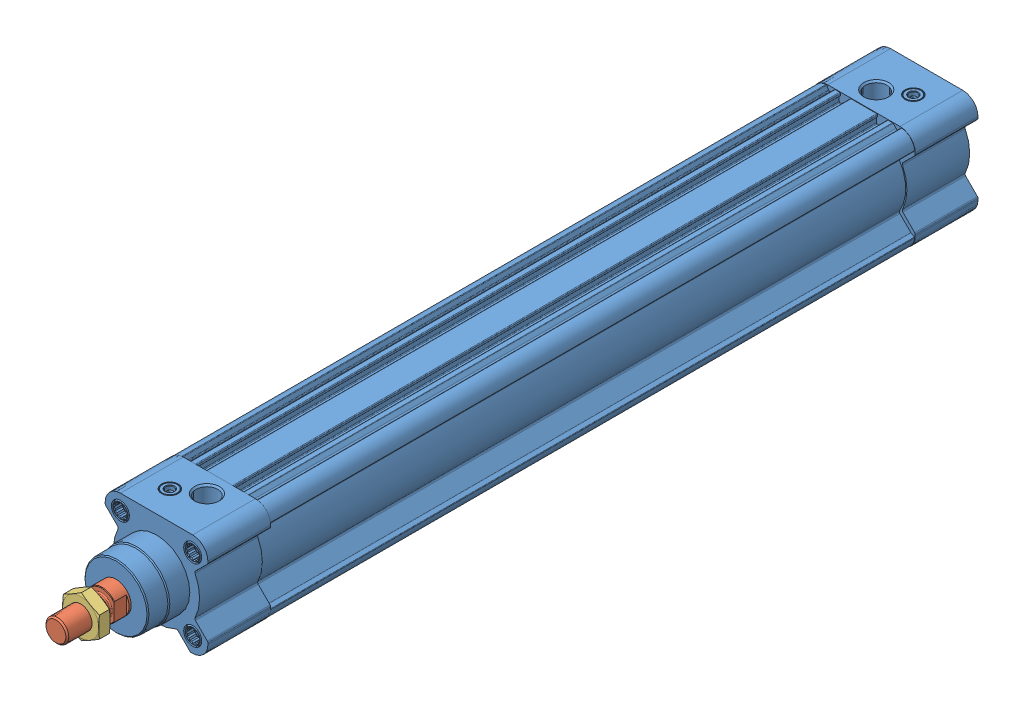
SolidWorks assembly dsbc-40-300-ppva-n3.SLDASM, configuration Default (file format 8000). Lengths in mm.
Overall size (54 54 461.9).
3 component instances, 3 part files, 0 mates.
Components (placement in the parent):
- dsbc-40-300-ppva-n3_01-1: dsbc-40-300-ppva-n3_01.SLDPRT [Default] at origin size (54 54 430.3)
- dsbc-40-300-ppva-n3_02-1: dsbc-40-300-ppva-n3_02.SLDPRT [Default] at origin size (40 40 424.9)
- dsbc-40-300-ppva-n3_03-1: dsbc-40-300-ppva-n3_03.SLDPRT [Default] at origin size (21.94 21.94 6)
